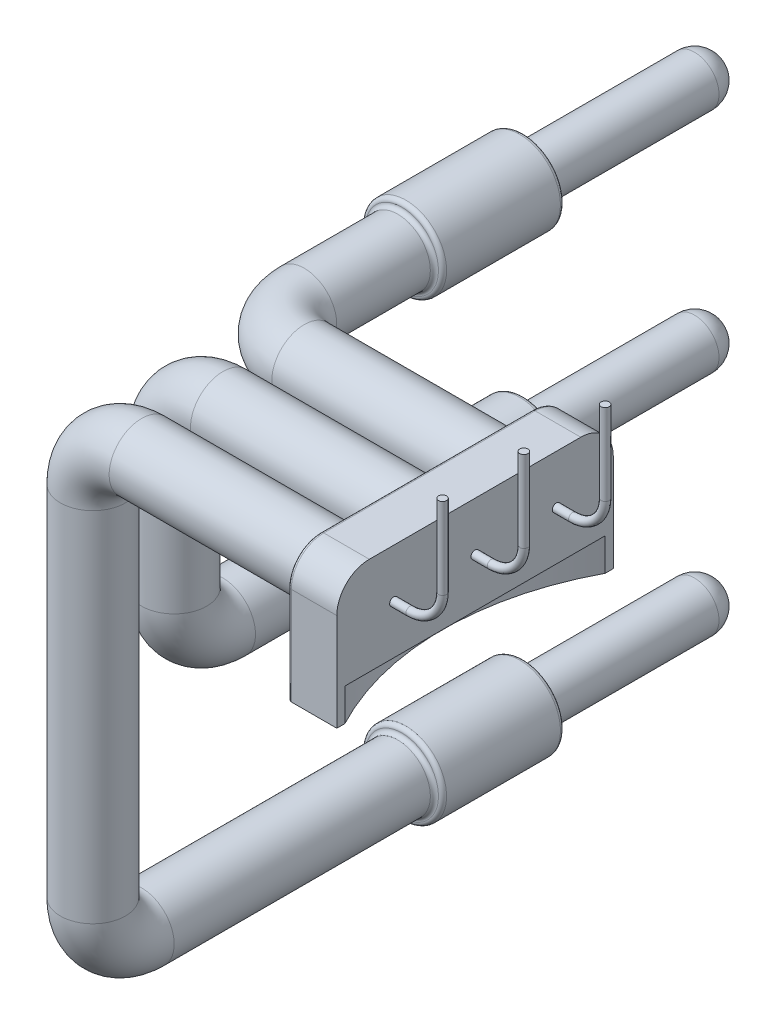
ISO-10303-21;
HEADER;
FILE_DESCRIPTION(('STEP AP214'),'2;1');
FILE_NAME('part.step','',(''),(''),'','','');
FILE_SCHEMA(('AUTOMOTIVE_DESIGN { 1 0 10303 214 1 1 1 1 }'));
ENDSEC;
DATA;
#1=APPLICATION_CONTEXT('core data for automotive mechanical design processes');
#2=APPLICATION_PROTOCOL_DEFINITION('international standard','automotive_design',2000,#1);
#3=PRODUCT_CONTEXT('',#1,'mechanical');
#4=PRODUCT('Part','Part','',(#3));
#5=PRODUCT_RELATED_PRODUCT_CATEGORY('part','',(#4));
#6=PRODUCT_DEFINITION_FORMATION('','',#4);
#7=PRODUCT_DEFINITION_CONTEXT('part definition',#1,'design');
#8=PRODUCT_DEFINITION('design','',#6,#7);
#9=PRODUCT_DEFINITION_SHAPE('','',#8);
#10=(LENGTH_UNIT() NAMED_UNIT(*) SI_UNIT(.MILLI.,.METRE.));
#11=(NAMED_UNIT(*) PLANE_ANGLE_UNIT() SI_UNIT($,.RADIAN.));
#12=(NAMED_UNIT(*) SI_UNIT($,.STERADIAN.) SOLID_ANGLE_UNIT());
#13=UNCERTAINTY_MEASURE_WITH_UNIT(LENGTH_MEASURE(1.E-05),#10,'distance_accuracy_value','');
#14=(GEOMETRIC_REPRESENTATION_CONTEXT(3) GLOBAL_UNCERTAINTY_ASSIGNED_CONTEXT((#13)) GLOBAL_UNIT_ASSIGNED_CONTEXT((#10,
#11,#12)) REPRESENTATION_CONTEXT('',''));
#15=CARTESIAN_POINT('',(0.,0.,0.));
#16=DIRECTION('',(0.,0.,1.));
#17=DIRECTION('',(1.,0.,0.));
#18=AXIS2_PLACEMENT_3D('',#15,#16,#17);
#19=CARTESIAN_POINT('',(18.5,1.,27.));
#20=DIRECTION('',(1.,0.,0.));
#21=DIRECTION('',(0.,0.,-1.));
#22=AXIS2_PLACEMENT_3D('',#19,#20,#21);
#23=PLANE('',#22);
#24=CARTESIAN_POINT('',(18.5,0.,33.5));
#25=DIRECTION('',(1.,0.,0.));
#26=DIRECTION('',(0.,0.,-1.));
#27=AXIS2_PLACEMENT_3D('',#24,#25,#26);
#28=CIRCLE('',#27,0.25);
#29=CARTESIAN_POINT('',(18.5,0.,33.25));
#30=VERTEX_POINT('',#29);
#31=EDGE_CURVE('E814',#30,#30,#28,.T.);
#32=ORIENTED_EDGE('',*,*,#31,.F.);
#33=EDGE_LOOP('',(#32));
#34=FACE_BOUND('',#33,.T.);
#35=DIRECTION('',(0.,0.,1.));
#36=VECTOR('',#35,1.);
#37=CARTESIAN_POINT('',(18.5,-3.,42.));
#38=LINE('',#37,#36);
#39=CARTESIAN_POINT('',(18.5,-3.,25.5));
#40=VERTEX_POINT('',#39);
#41=CARTESIAN_POINT('',(18.5,-2.99999999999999,41.5));
#42=VERTEX_POINT('',#41);
#43=EDGE_CURVE('E124',#40,#42,#38,.T.);
#44=ORIENTED_EDGE('',*,*,#43,.F.);
#45=DIRECTION('',(0.,1.,0.));
#46=VECTOR('',#45,1.);
#47=CARTESIAN_POINT('',(18.5,-5.,25.5));
#48=LINE('',#47,#46);
#49=CARTESIAN_POINT('',(18.5,-5.,25.5));
#50=VERTEX_POINT('',#49);
#51=EDGE_CURVE('E142',#50,#40,#48,.T.);
#52=ORIENTED_EDGE('',*,*,#51,.F.);
#53=DIRECTION('',(0.,0.,1.));
#54=VECTOR('',#53,1.);
#55=CARTESIAN_POINT('',(18.5,-5.,25.));
#56=LINE('',#55,#54);
#57=CARTESIAN_POINT('',(18.5,-5.,25.));
#58=VERTEX_POINT('',#57);
#59=EDGE_CURVE('E165',#58,#50,#56,.T.);
#60=ORIENTED_EDGE('',*,*,#59,.F.);
#61=DIRECTION('',(0.,-1.,0.));
#62=VECTOR('',#61,1.);
#63=CARTESIAN_POINT('',(18.5,-3.,25.));
#64=LINE('',#63,#62);
#65=CARTESIAN_POINT('',(18.5,1.,25.));
#66=VERTEX_POINT('',#65);
#67=EDGE_CURVE('E283',#66,#58,#64,.T.);
#68=ORIENTED_EDGE('',*,*,#67,.F.);
#69=CARTESIAN_POINT('',(18.5,1.,27.));
#70=DIRECTION('',(-1.,0.,0.));
#71=DIRECTION('',(0.,0.,-1.));
#72=AXIS2_PLACEMENT_3D('',#69,#70,#71);
#73=CIRCLE('',#72,2.);
#74=CARTESIAN_POINT('',(18.5,3.,27.));
#75=VERTEX_POINT('',#74);
#76=EDGE_CURVE('E291',#75,#66,#73,.T.);
#77=ORIENTED_EDGE('',*,*,#76,.F.);
#78=DIRECTION('',(0.,0.,-1.));
#79=VECTOR('',#78,1.);
#80=CARTESIAN_POINT('',(18.5,3.,27.));
#81=LINE('',#80,#79);
#82=CARTESIAN_POINT('',(18.5,3.,40.));
#83=VERTEX_POINT('',#82);
#84=EDGE_CURVE('E294',#83,#75,#81,.T.);
#85=ORIENTED_EDGE('',*,*,#84,.F.);
#86=CARTESIAN_POINT('',(18.5,1.,40.));
#87=DIRECTION('',(-1.,0.,0.));
#88=DIRECTION('',(0.,0.,1.));
#89=AXIS2_PLACEMENT_3D('',#86,#87,#88);
#90=CIRCLE('',#89,2.);
#91=CARTESIAN_POINT('',(18.5,1.,42.));
#92=VERTEX_POINT('',#91);
#93=EDGE_CURVE('E296',#92,#83,#90,.T.);
#94=ORIENTED_EDGE('',*,*,#93,.F.);
#95=DIRECTION('',(0.,1.,0.));
#96=VECTOR('',#95,1.);
#97=CARTESIAN_POINT('',(18.5,1.,42.));
#98=LINE('',#97,#96);
#99=CARTESIAN_POINT('',(18.5,-4.99999999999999,42.));
#100=VERTEX_POINT('',#99);
#101=EDGE_CURVE('E132',#100,#92,#98,.T.);
#102=ORIENTED_EDGE('',*,*,#101,.F.);
#103=DIRECTION('',(0.,0.,1.));
#104=VECTOR('',#103,1.);
#105=CARTESIAN_POINT('',(18.5,-4.99999999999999,41.5));
#106=LINE('',#105,#104);
#107=CARTESIAN_POINT('',(18.5,-4.99999999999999,41.5));
#108=VERTEX_POINT('',#107);
#109=EDGE_CURVE('E138',#108,#100,#106,.T.);
#110=ORIENTED_EDGE('',*,*,#109,.F.);
#111=DIRECTION('',(0.,1.,0.));
#112=VECTOR('',#111,1.);
#113=CARTESIAN_POINT('',(18.5,-4.99999999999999,41.5));
#114=LINE('',#113,#112);
#115=EDGE_CURVE('E133',#108,#42,#114,.T.);
#116=ORIENTED_EDGE('',*,*,#115,.T.);
#117=EDGE_LOOP('',(#44,#52,#60,#68,#77,#85,#94,#102,#110,#116));
#118=FACE_BOUND('',#117,.T.);
#119=CARTESIAN_POINT('',(18.5,0.,38.5));
#120=DIRECTION('',(1.,0.,0.));
#121=DIRECTION('',(0.,0.,-1.));
#122=AXIS2_PLACEMENT_3D('',#119,#120,#121);
#123=CIRCLE('',#122,0.25);
#124=CARTESIAN_POINT('',(18.5,0.,38.25));
#125=VERTEX_POINT('',#124);
#126=EDGE_CURVE('E833',#125,#125,#123,.T.);
#127=ORIENTED_EDGE('',*,*,#126,.F.);
#128=EDGE_LOOP('',(#127));
#129=FACE_BOUND('',#128,.T.);
#130=CARTESIAN_POINT('',(18.5,0.,28.5));
#131=DIRECTION('',(1.,0.,0.));
#132=DIRECTION('',(0.,0.,-1.));
#133=AXIS2_PLACEMENT_3D('',#130,#131,#132);
#134=CIRCLE('',#133,0.25);
#135=CARTESIAN_POINT('',(18.5,0.,28.25));
#136=VERTEX_POINT('',#135);
#137=EDGE_CURVE('E849',#136,#136,#134,.T.);
#138=ORIENTED_EDGE('',*,*,#137,.F.);
#139=EDGE_LOOP('',(#138));
#140=FACE_BOUND('',#139,.T.);
#141=ADVANCED_FACE('F30',(#34,#118,#129,#140),#23,.T.);
#142=CARTESIAN_POINT('',(1.06232211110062E-13,-28.,12.));
#143=DIRECTION('',(0.,0.,-1.));
#144=DIRECTION('',(-1.,0.,0.));
#145=AXIS2_PLACEMENT_3D('',#142,#143,#144);
#146=PLANE('',#145);
#147=CARTESIAN_POINT('',(1.06232211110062E-13,-28.,12.));
#148=DIRECTION('',(0.,0.,-1.));
#149=DIRECTION('',(-1.,0.,0.));
#150=AXIS2_PLACEMENT_3D('',#147,#148,#149);
#151=CIRCLE('',#150,2.25000000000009);
#152=CARTESIAN_POINT('',(-2.24999999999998,-28.,12.));
#153=VERTEX_POINT('',#152);
#154=EDGE_CURVE('E178',#153,#153,#151,.T.);
#155=ORIENTED_EDGE('',*,*,#154,.T.);
#156=EDGE_LOOP('',(#155));
#157=FACE_BOUND('',#156,.T.);
#158=CARTESIAN_POINT('',(0.,-28.,12.));
#159=DIRECTION('',(0.,0.,-1.));
#160=DIRECTION('',(-1.,0.,0.));
#161=AXIS2_PLACEMENT_3D('',#158,#159,#160);
#162=CIRCLE('',#161,1.5);
#163=CARTESIAN_POINT('',(-1.49999999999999,-28.,12.));
#164=VERTEX_POINT('',#163);
#165=EDGE_CURVE('E270',#164,#164,#162,.T.);
#166=ORIENTED_EDGE('',*,*,#165,.F.);
#167=EDGE_LOOP('',(#166));
#168=FACE_BOUND('',#167,.T.);
#169=ADVANCED_FACE('F391',(#157,#168),#146,.T.);
#170=CARTESIAN_POINT('',(1.0617403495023E-13,-14.,12.));
#171=DIRECTION('',(0.,0.,-1.));
#172=DIRECTION('',(-1.,0.,0.));
#173=AXIS2_PLACEMENT_3D('',#170,#171,#172);
#174=PLANE('',#173);
#175=CARTESIAN_POINT('',(1.0617403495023E-13,-14.,12.));
#176=DIRECTION('',(0.,0.,-1.));
#177=DIRECTION('',(-1.,0.,0.));
#178=AXIS2_PLACEMENT_3D('',#175,#176,#177);
#179=CIRCLE('',#178,2.25000000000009);
#180=CARTESIAN_POINT('',(-2.24999999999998,-14.,12.));
#181=VERTEX_POINT('',#180);
#182=EDGE_CURVE('E190',#181,#181,#179,.T.);
#183=ORIENTED_EDGE('',*,*,#182,.T.);
#184=EDGE_LOOP('',(#183));
#185=FACE_BOUND('',#184,.T.);
#186=CARTESIAN_POINT('',(0.,-14.,12.));
#187=DIRECTION('',(0.,0.,-1.));
#188=DIRECTION('',(-1.,0.,0.));
#189=AXIS2_PLACEMENT_3D('',#186,#187,#188);
#190=CIRCLE('',#189,1.5);
#191=CARTESIAN_POINT('',(-1.49999999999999,-14.,12.));
#192=VERTEX_POINT('',#191);
#193=EDGE_CURVE('E262',#192,#192,#190,.T.);
#194=ORIENTED_EDGE('',*,*,#193,.F.);
#195=EDGE_LOOP('',(#194));
#196=FACE_BOUND('',#195,.T.);
#197=ADVANCED_FACE('F397',(#185,#196),#174,.T.);
#198=CARTESIAN_POINT('',(15.5,0.,38.5));
#199=DIRECTION('',(1.,0.,0.));
#200=DIRECTION('',(0.,0.,-1.));
#201=AXIS2_PLACEMENT_3D('',#198,#199,#200);
#202=PLANE('',#201);
#203=DIRECTION('',(0.,-1.,0.));
#204=VECTOR('',#203,1.);
#205=CARTESIAN_POINT('',(15.5,-5.,25.2));
#206=LINE('',#205,#204);
#207=CARTESIAN_POINT('',(15.5,1.,25.2));
#208=VERTEX_POINT('',#207);
#209=CARTESIAN_POINT('',(15.5,-4.8,25.2));
#210=VERTEX_POINT('',#209);
#211=EDGE_CURVE('E355',#208,#210,#206,.T.);
#212=ORIENTED_EDGE('',*,*,#211,.T.);
#213=DIRECTION('',(0.,0.,-1.));
#214=VECTOR('',#213,1.);
#215=CARTESIAN_POINT('',(15.5,-4.8,42.));
#216=LINE('',#215,#214);
#217=CARTESIAN_POINT('',(15.5,-4.8,41.8));
#218=VERTEX_POINT('',#217);
#219=EDGE_CURVE('E345',#210,#218,#216,.F.);
#220=ORIENTED_EDGE('',*,*,#219,.T.);
#221=DIRECTION('',(0.,1.,0.));
#222=VECTOR('',#221,1.);
#223=CARTESIAN_POINT('',(15.5,1.,41.8));
#224=LINE('',#223,#222);
#225=CARTESIAN_POINT('',(15.5,1.,41.8));
#226=VERTEX_POINT('',#225);
#227=EDGE_CURVE('E350',#218,#226,#224,.T.);
#228=ORIENTED_EDGE('',*,*,#227,.T.);
#229=CARTESIAN_POINT('',(15.5,1.,40.));
#230=DIRECTION('',(1.,0.,0.));
#231=DIRECTION('',(0.,0.,-1.));
#232=AXIS2_PLACEMENT_3D('',#229,#230,#231);
#233=CIRCLE('',#232,1.8);
#234=CARTESIAN_POINT('',(15.5,2.8,40.));
#235=VERTEX_POINT('',#234);
#236=EDGE_CURVE('E353',#226,#235,#233,.F.);
#237=ORIENTED_EDGE('',*,*,#236,.T.);
#238=DIRECTION('',(0.,0.,-1.));
#239=VECTOR('',#238,1.);
#240=CARTESIAN_POINT('',(15.5,2.8,27.));
#241=LINE('',#240,#239);
#242=CARTESIAN_POINT('',(15.5,2.8,27.));
#243=VERTEX_POINT('',#242);
#244=EDGE_CURVE('E174',#235,#243,#241,.T.);
#245=ORIENTED_EDGE('',*,*,#244,.T.);
#246=CARTESIAN_POINT('',(15.5,1.,27.));
#247=DIRECTION('',(1.,0.,0.));
#248=DIRECTION('',(0.,0.,-1.));
#249=AXIS2_PLACEMENT_3D('',#246,#247,#248);
#250=CIRCLE('',#249,1.8);
#251=EDGE_CURVE('E325',#243,#208,#250,.F.);
#252=ORIENTED_EDGE('',*,*,#251,.T.);
#253=EDGE_LOOP('',(#212,#220,#228,#237,#245,#252));
#254=FACE_BOUND('',#253,.T.);
#255=CARTESIAN_POINT('',(15.5,0.,38.5));
#256=DIRECTION('',(-1.,0.,0.));
#257=DIRECTION('',(0.,0.,1.));
#258=AXIS2_PLACEMENT_3D('',#255,#256,#257);
#259=CIRCLE('',#258,2.);
#260=CARTESIAN_POINT('',(15.5,0.,40.5));
#261=VERTEX_POINT('',#260);
#262=EDGE_CURVE('E206',#261,#261,#259,.T.);
#263=ORIENTED_EDGE('',*,*,#262,.F.);
#264=EDGE_LOOP('',(#263));
#265=FACE_BOUND('',#264,.T.);
#266=CARTESIAN_POINT('',(15.5,0.,28.5));
#267=DIRECTION('',(1.,0.,0.));
#268=DIRECTION('',(0.,0.,-1.));
#269=AXIS2_PLACEMENT_3D('',#266,#267,#268);
#270=CIRCLE('',#269,2.);
#271=CARTESIAN_POINT('',(15.5,0.,26.5));
#272=VERTEX_POINT('',#271);
#273=EDGE_CURVE('E225',#272,#272,#270,.T.);
#274=ORIENTED_EDGE('',*,*,#273,.T.);
#275=EDGE_LOOP('',(#274));
#276=FACE_BOUND('',#275,.T.);
#277=CARTESIAN_POINT('',(15.5,0.,33.5));
#278=DIRECTION('',(-1.,0.,0.));
#279=DIRECTION('',(0.,0.,1.));
#280=AXIS2_PLACEMENT_3D('',#277,#278,#279);
#281=CIRCLE('',#280,2.);
#282=CARTESIAN_POINT('',(15.5,0.,35.5));
#283=VERTEX_POINT('',#282);
#284=EDGE_CURVE('E202',#283,#283,#281,.T.);
#285=ORIENTED_EDGE('',*,*,#284,.F.);
#286=EDGE_LOOP('',(#285));
#287=FACE_BOUND('',#286,.T.);
#288=ADVANCED_FACE('F360',(#254,#265,#276,#287),#202,.F.);
#289=CARTESIAN_POINT('',(0.,0.,12.));
#290=DIRECTION('',(0.,0.,-1.));
#291=DIRECTION('',(-1.,0.,0.));
#292=AXIS2_PLACEMENT_3D('',#289,#290,#291);
#293=CYLINDRICAL_SURFACE('',#292,1.5);
#294=CARTESIAN_POINT('',(0.,0.,1.5));
#295=DIRECTION('',(0.,0.,-1.));
#296=DIRECTION('',(-1.,0.,0.));
#297=AXIS2_PLACEMENT_3D('',#294,#295,#296);
#298=CIRCLE('',#297,1.5);
#299=CARTESIAN_POINT('',(-1.5,0.,1.5));
#300=VERTEX_POINT('',#299);
#301=EDGE_CURVE('E219',#300,#300,#298,.F.);
#302=ORIENTED_EDGE('',*,*,#301,.T.);
#303=EDGE_LOOP('',(#302));
#304=FACE_BOUND('',#303,.T.);
#305=CARTESIAN_POINT('',(0.,0.,12.));
#306=DIRECTION('',(0.,0.,1.));
#307=DIRECTION('',(1.,0.,0.));
#308=AXIS2_PLACEMENT_3D('',#305,#306,#307);
#309=CIRCLE('',#308,1.5);
#310=CARTESIAN_POINT('',(1.5,0.,12.));
#311=VERTEX_POINT('',#310);
#312=EDGE_CURVE('E222',#311,#311,#309,.T.);
#313=ORIENTED_EDGE('',*,*,#312,.F.);
#314=EDGE_LOOP('',(#313));
#315=FACE_BOUND('',#314,.T.);
#316=ADVANCED_FACE('F32',(#304,#315),#293,.T.);
#317=CARTESIAN_POINT('',(0.,0.,1.5));
#318=DIRECTION('',(0.,0.,1.));
#319=DIRECTION('',(1.,0.,0.));
#320=AXIS2_PLACEMENT_3D('',#317,#318,#319);
#321=SPHERICAL_SURFACE('',#320,1.5);
#322=ORIENTED_EDGE('',*,*,#301,.F.);
#323=EDGE_LOOP('',(#322));
#324=FACE_BOUND('',#323,.T.);
#325=ADVANCED_FACE('F538',(#324),#321,.T.);
#326=CARTESIAN_POINT('',(0.,0.,12.));
#327=DIRECTION('',(0.,0.,1.));
#328=DIRECTION('',(1.,0.,0.));
#329=AXIS2_PLACEMENT_3D('',#326,#327,#328);
#330=PLANE('',#329);
#331=CARTESIAN_POINT('',(0.,0.,12.));
#332=DIRECTION('',(0.,0.,1.));
#333=DIRECTION('',(1.,0.,0.));
#334=AXIS2_PLACEMENT_3D('',#331,#332,#333);
#335=CIRCLE('',#334,2.25);
#336=CARTESIAN_POINT('',(2.25,0.,12.));
#337=VERTEX_POINT('',#336);
#338=EDGE_CURVE('E210',#337,#337,#335,.F.);
#339=ORIENTED_EDGE('',*,*,#338,.T.);
#340=EDGE_LOOP('',(#339));
#341=FACE_BOUND('',#340,.T.);
#342=ORIENTED_EDGE('',*,*,#312,.T.);
#343=EDGE_LOOP('',(#342));
#344=FACE_BOUND('',#343,.T.);
#345=ADVANCED_FACE('F535',(#341,#344),#330,.F.);
#346=CARTESIAN_POINT('',(0.,0.,19.5));
#347=DIRECTION('',(0.,0.,-1.));
#348=DIRECTION('',(-1.,0.,0.));
#349=AXIS2_PLACEMENT_3D('',#346,#347,#348);
#350=CYLINDRICAL_SURFACE('',#349,2.5);
#351=CARTESIAN_POINT('',(0.,0.,12.25));
#352=DIRECTION('',(0.,0.,1.));
#353=DIRECTION('',(1.,0.,0.));
#354=AXIS2_PLACEMENT_3D('',#351,#352,#353);
#355=CIRCLE('',#354,2.5);
#356=CARTESIAN_POINT('',(2.5,0.,12.25));
#357=VERTEX_POINT('',#356);
#358=EDGE_CURVE('E213',#357,#357,#355,.T.);
#359=ORIENTED_EDGE('',*,*,#358,.T.);
#360=EDGE_LOOP('',(#359));
#361=FACE_BOUND('',#360,.T.);
#362=CARTESIAN_POINT('',(0.,0.,19.25));
#363=DIRECTION('',(0.,0.,1.));
#364=DIRECTION('',(1.,0.,0.));
#365=AXIS2_PLACEMENT_3D('',#362,#363,#364);
#366=CIRCLE('',#365,2.5);
#367=CARTESIAN_POINT('',(2.5,0.,19.25));
#368=VERTEX_POINT('',#367);
#369=EDGE_CURVE('E216',#368,#368,#366,.F.);
#370=ORIENTED_EDGE('',*,*,#369,.T.);
#371=EDGE_LOOP('',(#370));
#372=FACE_BOUND('',#371,.T.);
#373=ADVANCED_FACE('F533',(#361,#372),#350,.T.);
#374=CARTESIAN_POINT('',(0.,0.,20.5));
#375=DIRECTION('',(0.,0.,-1.));
#376=DIRECTION('',(-1.,0.,0.));
#377=AXIS2_PLACEMENT_3D('',#374,#375,#376);
#378=CYLINDRICAL_SURFACE('',#377,2.);
#379=CARTESIAN_POINT('',(0.,0.,19.75));
#380=DIRECTION('',(0.,0.,1.));
#381=DIRECTION('',(1.,0.,0.));
#382=AXIS2_PLACEMENT_3D('',#379,#380,#381);
#383=CIRCLE('',#382,2.);
#384=CARTESIAN_POINT('',(2.,0.,19.75));
#385=VERTEX_POINT('',#384);
#386=EDGE_CURVE('E203',#385,#385,#383,.T.);
#387=ORIENTED_EDGE('',*,*,#386,.T.);
#388=EDGE_LOOP('',(#387));
#389=FACE_BOUND('',#388,.T.);
#390=CARTESIAN_POINT('',(0.,0.,25.5));
#391=DIRECTION('',(0.,0.,1.));
#392=DIRECTION('',(1.,0.,0.));
#393=AXIS2_PLACEMENT_3D('',#390,#391,#392);
#394=CIRCLE('',#393,2.);
#395=CARTESIAN_POINT('',(-2.,0.,25.5));
#396=VERTEX_POINT('',#395);
#397=EDGE_CURVE('E231',#396,#396,#394,.T.);
#398=ORIENTED_EDGE('',*,*,#397,.F.);
#399=EDGE_LOOP('',(#398));
#400=FACE_BOUND('',#399,.T.);
#401=ADVANCED_FACE('F529',(#389,#400),#378,.T.);
#402=CARTESIAN_POINT('',(3.,0.,28.5));
#403=DIRECTION('',(1.,0.,0.));
#404=DIRECTION('',(0.,0.,-1.));
#405=AXIS2_PLACEMENT_3D('',#402,#403,#404);
#406=CYLINDRICAL_SURFACE('',#405,2.);
#407=CARTESIAN_POINT('',(3.,0.,28.5));
#408=DIRECTION('',(1.,0.,0.));
#409=DIRECTION('',(0.,0.,-1.));
#410=AXIS2_PLACEMENT_3D('',#407,#408,#409);
#411=CIRCLE('',#410,2.);
#412=CARTESIAN_POINT('',(3.,0.,30.5));
#413=VERTEX_POINT('',#412);
#414=EDGE_CURVE('E228',#413,#413,#411,.T.);
#415=ORIENTED_EDGE('',*,*,#414,.T.);
#416=EDGE_LOOP('',(#415));
#417=FACE_BOUND('',#416,.T.);
#418=ORIENTED_EDGE('',*,*,#273,.F.);
#419=EDGE_LOOP('',(#418));
#420=FACE_BOUND('',#419,.T.);
#421=ADVANCED_FACE('F525',(#417,#420),#406,.T.);
#422=CARTESIAN_POINT('',(3.,0.,25.5));
#423=DIRECTION('',(0.,1.,0.));
#424=DIRECTION('',(0.,0.,1.));
#425=AXIS2_PLACEMENT_3D('',#422,#423,#424);
#426=TOROIDAL_SURFACE('',#425,3.,2.);
#427=CARTESIAN_POINT('',(3.,0.,25.5));
#428=DIRECTION('',(0.,1.,0.));
#429=DIRECTION('',(0.,0.,1.));
#430=AXIS2_PLACEMENT_3D('',#427,#428,#429);
#431=CIRCLE('',#430,5.);
#432=EDGE_CURVE('',#396,#413,#431,.T.);
#433=ORIENTED_EDGE('',*,*,#397,.T.);
#434=ORIENTED_EDGE('',*,*,#414,.F.);
#435=ORIENTED_EDGE('',*,*,#432,.T.);
#436=ORIENTED_EDGE('',*,*,#432,.F.);
#437=EDGE_LOOP('',(#433,#435,#434,#436));
#438=FACE_BOUND('',#437,.T.);
#439=ADVANCED_FACE('F521',(#438),#426,.T.);
#440=CARTESIAN_POINT('',(0.,0.,12.25));
#441=DIRECTION('',(0.,0.,1.));
#442=DIRECTION('',(1.,0.,0.));
#443=AXIS2_PLACEMENT_3D('',#440,#441,#442);
#444=TOROIDAL_SURFACE('',#443,2.25,0.25);
#445=ORIENTED_EDGE('',*,*,#338,.F.);
#446=EDGE_LOOP('',(#445));
#447=FACE_BOUND('',#446,.T.);
#448=ORIENTED_EDGE('',*,*,#358,.F.);
#449=EDGE_LOOP('',(#448));
#450=FACE_BOUND('',#449,.T.);
#451=ADVANCED_FACE('F517',(#447,#450),#444,.T.);
#452=CARTESIAN_POINT('',(0.,0.,19.25));
#453=DIRECTION('',(0.,0.,1.));
#454=DIRECTION('',(1.,0.,0.));
#455=AXIS2_PLACEMENT_3D('',#452,#453,#454);
#456=TOROIDAL_SURFACE('',#455,2.25,0.25);
#457=ORIENTED_EDGE('',*,*,#369,.F.);
#458=EDGE_LOOP('',(#457));
#459=FACE_BOUND('',#458,.T.);
#460=CARTESIAN_POINT('',(0.,0.,19.5));
#461=DIRECTION('',(0.,0.,1.));
#462=DIRECTION('',(1.,0.,0.));
#463=AXIS2_PLACEMENT_3D('',#460,#461,#462);
#464=CIRCLE('',#463,2.25);
#465=CARTESIAN_POINT('',(2.25,0.,19.5));
#466=VERTEX_POINT('',#465);
#467=EDGE_CURVE('E207',#466,#466,#464,.T.);
#468=ORIENTED_EDGE('',*,*,#467,.F.);
#469=EDGE_LOOP('',(#468));
#470=FACE_BOUND('',#469,.T.);
#471=ADVANCED_FACE('F513',(#459,#470),#456,.T.);
#472=CARTESIAN_POINT('',(0.,0.,19.75));
#473=DIRECTION('',(0.,0.,1.));
#474=DIRECTION('',(1.,0.,0.));
#475=AXIS2_PLACEMENT_3D('',#472,#473,#474);
#476=TOROIDAL_SURFACE('',#475,2.25,0.25);
#477=ORIENTED_EDGE('',*,*,#467,.T.);
#478=EDGE_LOOP('',(#477));
#479=FACE_BOUND('',#478,.T.);
#480=ORIENTED_EDGE('',*,*,#386,.F.);
#481=EDGE_LOOP('',(#480));
#482=FACE_BOUND('',#481,.T.);
#483=ADVANCED_FACE('F507',(#479,#482),#476,.F.);
#484=CARTESIAN_POINT('',(0.,-3.00000000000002,38.5));
#485=DIRECTION('',(0.,-1.,0.));
#486=DIRECTION('',(1.,0.,0.));
#487=AXIS2_PLACEMENT_3D('',#484,#485,#486);
#488=CYLINDRICAL_SURFACE('',#487,2.);
#489=CARTESIAN_POINT('',(0.,-3.00000000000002,38.5));
#490=DIRECTION('',(0.,-1.,0.));
#491=DIRECTION('',(0.,0.,1.));
#492=AXIS2_PLACEMENT_3D('',#489,#490,#491);
#493=CIRCLE('',#492,2.);
#494=CARTESIAN_POINT('',(-2.,-3.00000000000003,38.5));
#495=VERTEX_POINT('',#494);
#496=EDGE_CURVE('E234',#495,#495,#493,.T.);
#497=ORIENTED_EDGE('',*,*,#496,.T.);
#498=EDGE_LOOP('',(#497));
#499=FACE_BOUND('',#498,.T.);
#500=CARTESIAN_POINT('',(0.,-25.,38.5));
#501=DIRECTION('',(0.,-1.,0.));
#502=DIRECTION('',(1.,0.,0.));
#503=AXIS2_PLACEMENT_3D('',#500,#501,#502);
#504=CIRCLE('',#503,2.00000000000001);
#505=CARTESIAN_POINT('',(0.,-25.,40.5));
#506=VERTEX_POINT('',#505);
#507=EDGE_CURVE('E259',#506,#506,#504,.T.);
#508=ORIENTED_EDGE('',*,*,#507,.F.);
#509=EDGE_LOOP('',(#508));
#510=FACE_BOUND('',#509,.T.);
#511=ADVANCED_FACE('F503',(#499,#510),#488,.T.);
#512=CARTESIAN_POINT('',(3.,-3.,38.5));
#513=DIRECTION('',(0.,0.,1.));
#514=DIRECTION('',(1.,0.,0.));
#515=AXIS2_PLACEMENT_3D('',#512,#513,#514);
#516=TOROIDAL_SURFACE('',#515,3.,2.);
#517=CARTESIAN_POINT('',(3.00000000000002,0.,38.5));
#518=DIRECTION('',(-1.,0.,0.));
#519=DIRECTION('',(0.,0.,1.));
#520=AXIS2_PLACEMENT_3D('',#517,#518,#519);
#521=CIRCLE('',#520,2.);
#522=CARTESIAN_POINT('',(3.00000000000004,2.,38.5));
#523=VERTEX_POINT('',#522);
#524=EDGE_CURVE('E237',#523,#523,#521,.T.);
#525=CARTESIAN_POINT('',(3.,-3.,38.5));
#526=DIRECTION('',(0.,0.,1.));
#527=DIRECTION('',(1.,0.,0.));
#528=AXIS2_PLACEMENT_3D('',#525,#526,#527);
#529=CIRCLE('',#528,5.);
#530=EDGE_CURVE('',#523,#495,#529,.T.);
#531=ORIENTED_EDGE('',*,*,#524,.T.);
#532=ORIENTED_EDGE('',*,*,#496,.F.);
#533=ORIENTED_EDGE('',*,*,#530,.T.);
#534=ORIENTED_EDGE('',*,*,#530,.F.);
#535=EDGE_LOOP('',(#531,#533,#532,#534));
#536=FACE_BOUND('',#535,.T.);
#537=ADVANCED_FACE('F499',(#536),#516,.T.);
#538=CARTESIAN_POINT('',(3.00000000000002,0.,38.5));
#539=DIRECTION('',(1.,0.,0.));
#540=DIRECTION('',(0.,1.,0.));
#541=AXIS2_PLACEMENT_3D('',#538,#539,#540);
#542=CYLINDRICAL_SURFACE('',#541,2.);
#543=ORIENTED_EDGE('',*,*,#524,.F.);
#544=EDGE_LOOP('',(#543));
#545=FACE_BOUND('',#544,.T.);
#546=ORIENTED_EDGE('',*,*,#262,.T.);
#547=EDGE_LOOP('',(#546));
#548=FACE_BOUND('',#547,.T.);
#549=ADVANCED_FACE('F495',(#545,#548),#542,.T.);
#550=CARTESIAN_POINT('',(0.,-3.00000000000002,33.5));
#551=DIRECTION('',(0.,-1.,0.));
#552=DIRECTION('',(0.,0.,-1.));
#553=AXIS2_PLACEMENT_3D('',#550,#551,#552);
#554=CYLINDRICAL_SURFACE('',#553,2.);
#555=CARTESIAN_POINT('',(0.,-3.00000000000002,33.5));
#556=DIRECTION('',(0.,-1.,0.));
#557=DIRECTION('',(0.,0.,1.));
#558=AXIS2_PLACEMENT_3D('',#555,#556,#557);
#559=CIRCLE('',#558,2.);
#560=CARTESIAN_POINT('',(-2.,-3.00000000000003,33.5));
#561=VERTEX_POINT('',#560);
#562=EDGE_CURVE('E240',#561,#561,#559,.T.);
#563=ORIENTED_EDGE('',*,*,#562,.T.);
#564=EDGE_LOOP('',(#563));
#565=FACE_BOUND('',#564,.T.);
#566=CARTESIAN_POINT('',(0.,-11.,33.5));
#567=DIRECTION('',(0.,-1.,0.));
#568=DIRECTION('',(1.,0.,0.));
#569=AXIS2_PLACEMENT_3D('',#566,#567,#568);
#570=CIRCLE('',#569,2.);
#571=CARTESIAN_POINT('',(0.,-11.,35.5));
#572=VERTEX_POINT('',#571);
#573=EDGE_CURVE('E253',#572,#572,#570,.T.);
#574=ORIENTED_EDGE('',*,*,#573,.F.);
#575=EDGE_LOOP('',(#574));
#576=FACE_BOUND('',#575,.T.);
#577=ADVANCED_FACE('F491',(#565,#576),#554,.T.);
#578=CARTESIAN_POINT('',(3.,-3.,33.5));
#579=DIRECTION('',(0.,0.,1.));
#580=DIRECTION('',(1.,0.,0.));
#581=AXIS2_PLACEMENT_3D('',#578,#579,#580);
#582=TOROIDAL_SURFACE('',#581,3.,2.);
#583=CARTESIAN_POINT('',(3.00000000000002,0.,33.5));
#584=DIRECTION('',(-1.,0.,0.));
#585=DIRECTION('',(0.,0.,1.));
#586=AXIS2_PLACEMENT_3D('',#583,#584,#585);
#587=CIRCLE('',#586,2.);
#588=CARTESIAN_POINT('',(3.00000000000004,2.,33.5));
#589=VERTEX_POINT('',#588);
#590=EDGE_CURVE('E245',#589,#589,#587,.T.);
#591=CARTESIAN_POINT('',(3.,-3.,33.5));
#592=DIRECTION('',(0.,0.,1.));
#593=DIRECTION('',(1.,0.,0.));
#594=AXIS2_PLACEMENT_3D('',#591,#592,#593);
#595=CIRCLE('',#594,5.);
#596=EDGE_CURVE('',#589,#561,#595,.T.);
#597=ORIENTED_EDGE('',*,*,#590,.T.);
#598=ORIENTED_EDGE('',*,*,#562,.F.);
#599=ORIENTED_EDGE('',*,*,#596,.T.);
#600=ORIENTED_EDGE('',*,*,#596,.F.);
#601=EDGE_LOOP('',(#597,#599,#598,#600));
#602=FACE_BOUND('',#601,.T.);
#603=ADVANCED_FACE('F487',(#602),#582,.T.);
#604=CARTESIAN_POINT('',(3.00000000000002,0.,33.5));
#605=DIRECTION('',(1.,0.,0.));
#606=DIRECTION('',(0.,0.,-1.));
#607=AXIS2_PLACEMENT_3D('',#604,#605,#606);
#608=CYLINDRICAL_SURFACE('',#607,2.);
#609=ORIENTED_EDGE('',*,*,#590,.F.);
#610=EDGE_LOOP('',(#609));
#611=FACE_BOUND('',#610,.T.);
#612=ORIENTED_EDGE('',*,*,#284,.T.);
#613=EDGE_LOOP('',(#612));
#614=FACE_BOUND('',#613,.T.);
#615=ADVANCED_FACE('F483',(#611,#614),#608,.T.);
#616=CARTESIAN_POINT('',(0.,-14.,30.5));
#617=DIRECTION('',(0.,0.,-1.));
#618=DIRECTION('',(0.,1.,0.));
#619=AXIS2_PLACEMENT_3D('',#616,#617,#618);
#620=CYLINDRICAL_SURFACE('',#619,2.);
#621=CARTESIAN_POINT('',(0.,-14.,19.75));
#622=DIRECTION('',(0.,0.,-1.));
#623=DIRECTION('',(-1.,0.,0.));
#624=AXIS2_PLACEMENT_3D('',#621,#622,#623);
#625=CIRCLE('',#624,2.);
#626=CARTESIAN_POINT('',(-2.,-14.,19.75));
#627=VERTEX_POINT('',#626);
#628=EDGE_CURVE('E187',#627,#627,#625,.F.);
#629=ORIENTED_EDGE('',*,*,#628,.T.);
#630=EDGE_LOOP('',(#629));
#631=FACE_BOUND('',#630,.T.);
#632=CARTESIAN_POINT('',(0.,-14.,30.5));
#633=DIRECTION('',(0.,0.,-1.));
#634=DIRECTION('',(1.,0.,0.));
#635=AXIS2_PLACEMENT_3D('',#632,#633,#634);
#636=CIRCLE('',#635,2.);
#637=CARTESIAN_POINT('',(0.,-16.,30.5));
#638=VERTEX_POINT('',#637);
#639=EDGE_CURVE('E248',#638,#638,#636,.T.);
#640=ORIENTED_EDGE('',*,*,#639,.T.);
#641=EDGE_LOOP('',(#640));
#642=FACE_BOUND('',#641,.T.);
#643=ADVANCED_FACE('F479',(#631,#642),#620,.T.);
#644=CARTESIAN_POINT('',(0.,-11.,30.5));
#645=DIRECTION('',(1.,0.,0.));
#646=DIRECTION('',(0.,0.,-1.));
#647=AXIS2_PLACEMENT_3D('',#644,#645,#646);
#648=TOROIDAL_SURFACE('',#647,3.,2.);
#649=CARTESIAN_POINT('',(0.,-11.,30.5));
#650=DIRECTION('',(1.,0.,0.));
#651=DIRECTION('',(0.,0.,-1.));
#652=AXIS2_PLACEMENT_3D('',#649,#650,#651);
#653=CIRCLE('',#652,5.);
#654=EDGE_CURVE('',#572,#638,#653,.T.);
#655=ORIENTED_EDGE('',*,*,#573,.T.);
#656=ORIENTED_EDGE('',*,*,#639,.F.);
#657=ORIENTED_EDGE('',*,*,#654,.T.);
#658=ORIENTED_EDGE('',*,*,#654,.F.);
#659=EDGE_LOOP('',(#655,#657,#656,#658));
#660=FACE_BOUND('',#659,.T.);
#661=ADVANCED_FACE('F475',(#660),#648,.T.);
#662=CARTESIAN_POINT('',(0.,-28.,35.5));
#663=DIRECTION('',(0.,0.,-1.));
#664=DIRECTION('',(0.,1.,0.));
#665=AXIS2_PLACEMENT_3D('',#662,#663,#664);
#666=CYLINDRICAL_SURFACE('',#665,2.00000000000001);
#667=CARTESIAN_POINT('',(0.,-28.,19.75));
#668=DIRECTION('',(0.,0.,-1.));
#669=DIRECTION('',(-1.,0.,0.));
#670=AXIS2_PLACEMENT_3D('',#667,#668,#669);
#671=CIRCLE('',#670,2.00000000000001);
#672=CARTESIAN_POINT('',(-2.,-28.,19.75));
#673=VERTEX_POINT('',#672);
#674=EDGE_CURVE('E175',#673,#673,#671,.F.);
#675=ORIENTED_EDGE('',*,*,#674,.T.);
#676=EDGE_LOOP('',(#675));
#677=FACE_BOUND('',#676,.T.);
#678=CARTESIAN_POINT('',(0.,-28.,35.5));
#679=DIRECTION('',(0.,0.,-1.));
#680=DIRECTION('',(1.,0.,0.));
#681=AXIS2_PLACEMENT_3D('',#678,#679,#680);
#682=CIRCLE('',#681,2.00000000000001);
#683=CARTESIAN_POINT('',(0.,-30.,35.5));
#684=VERTEX_POINT('',#683);
#685=EDGE_CURVE('E256',#684,#684,#682,.T.);
#686=ORIENTED_EDGE('',*,*,#685,.T.);
#687=EDGE_LOOP('',(#686));
#688=FACE_BOUND('',#687,.T.);
#689=ADVANCED_FACE('F471',(#677,#688),#666,.T.);
#690=CARTESIAN_POINT('',(0.,-25.,35.5));
#691=DIRECTION('',(1.,0.,0.));
#692=DIRECTION('',(0.,0.,-1.));
#693=AXIS2_PLACEMENT_3D('',#690,#691,#692);
#694=TOROIDAL_SURFACE('',#693,3.00000000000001,2.00000000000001);
#695=CARTESIAN_POINT('',(0.,-25.,35.5));
#696=DIRECTION('',(1.,0.,0.));
#697=DIRECTION('',(0.,0.,-1.));
#698=AXIS2_PLACEMENT_3D('',#695,#696,#697);
#699=CIRCLE('',#698,5.00000000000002);
#700=EDGE_CURVE('',#506,#684,#699,.T.);
#701=ORIENTED_EDGE('',*,*,#507,.T.);
#702=ORIENTED_EDGE('',*,*,#685,.F.);
#703=ORIENTED_EDGE('',*,*,#700,.T.);
#704=ORIENTED_EDGE('',*,*,#700,.F.);
#705=EDGE_LOOP('',(#701,#703,#702,#704));
#706=FACE_BOUND('',#705,.T.);
#707=ADVANCED_FACE('F467',(#706),#694,.T.);
#708=CARTESIAN_POINT('',(1.0617403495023E-13,-14.,12.));
#709=DIRECTION('',(0.,0.,1.));
#710=DIRECTION('',(1.,0.,0.));
#711=AXIS2_PLACEMENT_3D('',#708,#709,#710);
#712=CYLINDRICAL_SURFACE('',#711,2.50000000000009);
#713=CARTESIAN_POINT('',(0.,-14.,19.25));
#714=DIRECTION('',(0.,0.,-1.));
#715=DIRECTION('',(-1.,0.,0.));
#716=AXIS2_PLACEMENT_3D('',#713,#714,#715);
#717=CIRCLE('',#716,2.50000000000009);
#718=CARTESIAN_POINT('',(-2.50000000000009,-14.,19.25));
#719=VERTEX_POINT('',#718);
#720=EDGE_CURVE('E193',#719,#719,#717,.T.);
#721=ORIENTED_EDGE('',*,*,#720,.T.);
#722=EDGE_LOOP('',(#721));
#723=FACE_BOUND('',#722,.T.);
#724=CARTESIAN_POINT('',(1.02636628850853E-13,-14.,12.25));
#725=DIRECTION('',(0.,0.,-1.));
#726=DIRECTION('',(-1.,0.,0.));
#727=AXIS2_PLACEMENT_3D('',#724,#725,#726);
#728=CIRCLE('',#727,2.50000000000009);
#729=CARTESIAN_POINT('',(-2.49999999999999,-14.,12.25));
#730=VERTEX_POINT('',#729);
#731=EDGE_CURVE('E196',#730,#730,#728,.F.);
#732=ORIENTED_EDGE('',*,*,#731,.T.);
#733=EDGE_LOOP('',(#732));
#734=FACE_BOUND('',#733,.T.);
#735=ADVANCED_FACE('F460',(#723,#734),#712,.T.);
#736=CARTESIAN_POINT('',(1.8399696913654E-13,-14.,0.));
#737=DIRECTION('',(0.,0.,1.));
#738=DIRECTION('',(1.,0.,0.));
#739=AXIS2_PLACEMENT_3D('',#736,#737,#738);
#740=CYLINDRICAL_SURFACE('',#739,1.5);
#741=CARTESIAN_POINT('',(1.62772532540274E-13,-14.,1.5));
#742=DIRECTION('',(0.,0.,1.));
#743=DIRECTION('',(1.,0.,0.));
#744=AXIS2_PLACEMENT_3D('',#741,#742,#743);
#745=CIRCLE('',#744,1.5);
#746=CARTESIAN_POINT('',(1.50000000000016,-14.,1.50000000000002));
#747=VERTEX_POINT('',#746);
#748=EDGE_CURVE('E199',#747,#747,#745,.T.);
#749=ORIENTED_EDGE('',*,*,#748,.T.);
#750=EDGE_LOOP('',(#749));
#751=FACE_BOUND('',#750,.T.);
#752=ORIENTED_EDGE('',*,*,#193,.T.);
#753=EDGE_LOOP('',(#752));
#754=FACE_BOUND('',#753,.T.);
#755=ADVANCED_FACE('F456',(#751,#754),#740,.T.);
#756=CARTESIAN_POINT('',(1.62772532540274E-13,-14.,1.5));
#757=DIRECTION('',(0.,0.,1.));
#758=DIRECTION('',(1.,0.,0.));
#759=AXIS2_PLACEMENT_3D('',#756,#757,#758);
#760=SPHERICAL_SURFACE('',#759,1.5);
#761=ORIENTED_EDGE('',*,*,#748,.F.);
#762=EDGE_LOOP('',(#761));
#763=FACE_BOUND('',#762,.T.);
#764=ADVANCED_FACE('F452',(#763),#760,.T.);
#765=CARTESIAN_POINT('',(0.,-14.,19.75));
#766=DIRECTION('',(0.,0.,-1.));
#767=DIRECTION('',(-1.,0.,0.));
#768=AXIS2_PLACEMENT_3D('',#765,#766,#767);
#769=TOROIDAL_SURFACE('',#768,2.25,0.25);
#770=ORIENTED_EDGE('',*,*,#628,.F.);
#771=EDGE_LOOP('',(#770));
#772=FACE_BOUND('',#771,.T.);
#773=CARTESIAN_POINT('',(0.,-14.,19.5));
#774=DIRECTION('',(0.,0.,-1.));
#775=DIRECTION('',(-1.,0.,0.));
#776=AXIS2_PLACEMENT_3D('',#773,#774,#775);
#777=CIRCLE('',#776,2.25);
#778=CARTESIAN_POINT('',(2.25000000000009,-14.,19.5));
#779=VERTEX_POINT('',#778);
#780=CARTESIAN_POINT('',(-2.25000000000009,-14.,19.5));
#781=VERTEX_POINT('',#780);
#782=EDGE_CURVE('E265',#779,#781,#777,.T.);
#783=ORIENTED_EDGE('',*,*,#782,.F.);
#784=CARTESIAN_POINT('',(0.,-14.,19.5));
#785=DIRECTION('',(0.,0.,-1.));
#786=DIRECTION('',(-1.,0.,0.));
#787=AXIS2_PLACEMENT_3D('',#784,#785,#786);
#788=CIRCLE('',#787,2.25);
#789=EDGE_CURVE('E267',#781,#779,#788,.T.);
#790=ORIENTED_EDGE('',*,*,#789,.F.);
#791=EDGE_LOOP('',(#783,#790));
#792=FACE_BOUND('',#791,.T.);
#793=ADVANCED_FACE('F448',(#772,#792),#769,.F.);
#794=CARTESIAN_POINT('',(0.,-14.,19.25));
#795=DIRECTION('',(0.,0.,-1.));
#796=DIRECTION('',(-1.,0.,0.));
#797=AXIS2_PLACEMENT_3D('',#794,#795,#796);
#798=TOROIDAL_SURFACE('',#797,2.25000000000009,0.25);
#799=ORIENTED_EDGE('',*,*,#789,.T.);
#800=ORIENTED_EDGE('',*,*,#782,.T.);
#801=EDGE_LOOP('',(#799,#800));
#802=FACE_BOUND('',#801,.T.);
#803=ORIENTED_EDGE('',*,*,#720,.F.);
#804=EDGE_LOOP('',(#803));
#805=FACE_BOUND('',#804,.T.);
#806=ADVANCED_FACE('F444',(#802,#805),#798,.T.);
#807=CARTESIAN_POINT('',(1.02636628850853E-13,-14.,12.25));
#808=DIRECTION('',(0.,0.,-1.));
#809=DIRECTION('',(-1.,0.,0.));
#810=AXIS2_PLACEMENT_3D('',#807,#808,#809);
#811=TOROIDAL_SURFACE('',#810,2.25000000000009,0.25);
#812=ORIENTED_EDGE('',*,*,#731,.F.);
#813=EDGE_LOOP('',(#812));
#814=FACE_BOUND('',#813,.T.);
#815=ORIENTED_EDGE('',*,*,#182,.F.);
#816=EDGE_LOOP('',(#815));
#817=FACE_BOUND('',#816,.T.);
#818=ADVANCED_FACE('F440',(#814,#817),#811,.T.);
#819=CARTESIAN_POINT('',(1.06232211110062E-13,-28.,12.));
#820=DIRECTION('',(0.,0.,1.));
#821=DIRECTION('',(1.,0.,0.));
#822=AXIS2_PLACEMENT_3D('',#819,#820,#821);
#823=CYLINDRICAL_SURFACE('',#822,2.50000000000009);
#824=CARTESIAN_POINT('',(0.,-28.,19.25));
#825=DIRECTION('',(0.,0.,-1.));
#826=DIRECTION('',(-1.,0.,0.));
#827=AXIS2_PLACEMENT_3D('',#824,#825,#826);
#828=CIRCLE('',#827,2.50000000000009);
#829=CARTESIAN_POINT('',(-2.50000000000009,-28.,19.25));
#830=VERTEX_POINT('',#829);
#831=EDGE_CURVE('E181',#830,#830,#828,.T.);
#832=ORIENTED_EDGE('',*,*,#831,.T.);
#833=EDGE_LOOP('',(#832));
#834=FACE_BOUND('',#833,.T.);
#835=CARTESIAN_POINT('',(1.02750316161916E-13,-28.,12.25));
#836=DIRECTION('',(0.,0.,-1.));
#837=DIRECTION('',(-1.,0.,0.));
#838=AXIS2_PLACEMENT_3D('',#835,#836,#837);
#839=CIRCLE('',#838,2.50000000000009);
#840=CARTESIAN_POINT('',(-2.49999999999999,-28.,12.25));
#841=VERTEX_POINT('',#840);
#842=EDGE_CURVE('E184',#841,#841,#839,.F.);
#843=ORIENTED_EDGE('',*,*,#842,.T.);
#844=EDGE_LOOP('',(#843));
#845=FACE_BOUND('',#844,.T.);
#846=ADVANCED_FACE('F435',(#834,#845),#823,.T.);
#847=CARTESIAN_POINT('',(1.81599311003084E-13,-28.,0.));
#848=DIRECTION('',(0.,0.,1.));
#849=DIRECTION('',(1.,0.,0.));
#850=AXIS2_PLACEMENT_3D('',#847,#848,#849);
#851=CYLINDRICAL_SURFACE('',#850,1.5);
#852=CARTESIAN_POINT('',(1.60707941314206E-13,-28.,1.49999999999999));
#853=DIRECTION('',(0.,0.,1.));
#854=DIRECTION('',(1.,0.,0.));
#855=AXIS2_PLACEMENT_3D('',#852,#853,#854);
#856=CIRCLE('',#855,1.5);
#857=CARTESIAN_POINT('',(1.50000000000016,-28.,1.50000000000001));
#858=VERTEX_POINT('',#857);
#859=EDGE_CURVE('E171',#858,#858,#856,.T.);
#860=ORIENTED_EDGE('',*,*,#859,.T.);
#861=EDGE_LOOP('',(#860));
#862=FACE_BOUND('',#861,.T.);
#863=ORIENTED_EDGE('',*,*,#165,.T.);
#864=EDGE_LOOP('',(#863));
#865=FACE_BOUND('',#864,.T.);
#866=ADVANCED_FACE('F432',(#862,#865),#851,.T.);
#867=CARTESIAN_POINT('',(0.,-28.,19.75));
#868=DIRECTION('',(0.,0.,-1.));
#869=DIRECTION('',(-1.,0.,0.));
#870=AXIS2_PLACEMENT_3D('',#867,#868,#869);
#871=TOROIDAL_SURFACE('',#870,2.25000000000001,0.25);
#872=ORIENTED_EDGE('',*,*,#674,.F.);
#873=EDGE_LOOP('',(#872));
#874=FACE_BOUND('',#873,.T.);
#875=CARTESIAN_POINT('',(0.,-28.,19.5));
#876=DIRECTION('',(0.,0.,-1.));
#877=DIRECTION('',(-1.,0.,0.));
#878=AXIS2_PLACEMENT_3D('',#875,#876,#877);
#879=CIRCLE('',#878,2.25000000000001);
#880=CARTESIAN_POINT('',(2.25000000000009,-28.,19.5));
#881=VERTEX_POINT('',#880);
#882=CARTESIAN_POINT('',(-2.25000000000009,-28.,19.5));
#883=VERTEX_POINT('',#882);
#884=EDGE_CURVE('E273',#881,#883,#879,.T.);
#885=ORIENTED_EDGE('',*,*,#884,.F.);
#886=CARTESIAN_POINT('',(0.,-28.,19.5));
#887=DIRECTION('',(0.,0.,-1.));
#888=DIRECTION('',(-1.,0.,0.));
#889=AXIS2_PLACEMENT_3D('',#886,#887,#888);
#890=CIRCLE('',#889,2.25000000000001);
#891=EDGE_CURVE('E275',#883,#881,#890,.T.);
#892=ORIENTED_EDGE('',*,*,#891,.F.);
#893=EDGE_LOOP('',(#885,#892));
#894=FACE_BOUND('',#893,.T.);
#895=ADVANCED_FACE('F428',(#874,#894),#871,.F.);
#896=CARTESIAN_POINT('',(0.,-28.,19.25));
#897=DIRECTION('',(0.,0.,-1.));
#898=DIRECTION('',(-1.,0.,0.));
#899=AXIS2_PLACEMENT_3D('',#896,#897,#898);
#900=TOROIDAL_SURFACE('',#899,2.25000000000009,0.25);
#901=ORIENTED_EDGE('',*,*,#891,.T.);
#902=ORIENTED_EDGE('',*,*,#884,.T.);
#903=EDGE_LOOP('',(#901,#902));
#904=FACE_BOUND('',#903,.T.);
#905=ORIENTED_EDGE('',*,*,#831,.F.);
#906=EDGE_LOOP('',(#905));
#907=FACE_BOUND('',#906,.T.);
#908=ADVANCED_FACE('F424',(#904,#907),#900,.T.);
#909=CARTESIAN_POINT('',(1.02750316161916E-13,-28.,12.25));
#910=DIRECTION('',(0.,0.,-1.));
#911=DIRECTION('',(-1.,0.,0.));
#912=AXIS2_PLACEMENT_3D('',#909,#910,#911);
#913=TOROIDAL_SURFACE('',#912,2.25000000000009,0.25);
#914=ORIENTED_EDGE('',*,*,#842,.F.);
#915=EDGE_LOOP('',(#914));
#916=FACE_BOUND('',#915,.T.);
#917=ORIENTED_EDGE('',*,*,#154,.F.);
#918=EDGE_LOOP('',(#917));
#919=FACE_BOUND('',#918,.T.);
#920=ADVANCED_FACE('F420',(#916,#919),#913,.T.);
#921=CARTESIAN_POINT('',(1.60707941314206E-13,-28.,1.49999999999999));
#922=DIRECTION('',(0.,0.,1.));
#923=DIRECTION('',(1.,0.,0.));
#924=AXIS2_PLACEMENT_3D('',#921,#922,#923);
#925=SPHERICAL_SURFACE('',#924,1.5);
#926=ORIENTED_EDGE('',*,*,#859,.F.);
#927=EDGE_LOOP('',(#926));
#928=FACE_BOUND('',#927,.T.);
#929=ADVANCED_FACE('F417',(#928),#925,.T.);
#930=CARTESIAN_POINT('',(18.5,-3.,42.));
#931=DIRECTION('',(0.,-1.,0.));
#932=DIRECTION('',(0.,0.,-1.));
#933=AXIS2_PLACEMENT_3D('',#930,#931,#932);
#934=PLANE('',#933);
#935=CARTESIAN_POINT('',(33.5,-3.,33.5));
#936=DIRECTION('',(0.,1.,0.));
#937=DIRECTION('',(0.,0.,-1.));
#938=AXIS2_PLACEMENT_3D('',#935,#936,#937);
#939=CIRCLE('',#938,17.);
#940=EDGE_CURVE('E128',#40,#42,#939,.T.);
#941=ORIENTED_EDGE('',*,*,#940,.F.);
#942=ORIENTED_EDGE('',*,*,#43,.T.);
#943=EDGE_LOOP('',(#941,#942));
#944=FACE_BOUND('',#943,.T.);
#945=ADVANCED_FACE('F126',(#944),#934,.T.);
#946=CARTESIAN_POINT('',(18.5,-3.,25.));
#947=DIRECTION('',(0.,0.,-1.));
#948=DIRECTION('',(-1.,0.,0.));
#949=AXIS2_PLACEMENT_3D('',#946,#947,#948);
#950=PLANE('',#949);
#951=DIRECTION('',(1.,0.,0.));
#952=VECTOR('',#951,1.);
#953=CARTESIAN_POINT('',(15.5,-5.,25.));
#954=LINE('',#953,#952);
#955=CARTESIAN_POINT('',(15.7,-5.,25.));
#956=VERTEX_POINT('',#955);
#957=EDGE_CURVE('E163',#956,#58,#954,.T.);
#958=ORIENTED_EDGE('',*,*,#957,.F.);
#959=DIRECTION('',(0.,-1.,0.));
#960=VECTOR('',#959,1.);
#961=CARTESIAN_POINT('',(15.7,1.,25.));
#962=LINE('',#961,#960);
#963=CARTESIAN_POINT('',(15.7,1.,25.));
#964=VERTEX_POINT('',#963);
#965=EDGE_CURVE('E314',#956,#964,#962,.F.);
#966=ORIENTED_EDGE('',*,*,#965,.T.);
#967=DIRECTION('',(-1.,0.,0.));
#968=VECTOR('',#967,1.);
#969=CARTESIAN_POINT('',(18.5,1.,25.));
#970=LINE('',#969,#968);
#971=EDGE_CURVE('E278',#66,#964,#970,.T.);
#972=ORIENTED_EDGE('',*,*,#971,.F.);
#973=ORIENTED_EDGE('',*,*,#67,.T.);
#974=EDGE_LOOP('',(#958,#966,#972,#973));
#975=FACE_BOUND('',#974,.T.);
#976=ADVANCED_FACE('F312',(#975),#950,.T.);
#977=CARTESIAN_POINT('',(18.5,1.,27.));
#978=DIRECTION('',(-1.,0.,0.));
#979=DIRECTION('',(0.,0.,1.));
#980=AXIS2_PLACEMENT_3D('',#977,#978,#979);
#981=CYLINDRICAL_SURFACE('',#980,2.);
#982=ORIENTED_EDGE('',*,*,#971,.T.);
#983=CARTESIAN_POINT('',(15.7,1.,27.));
#984=DIRECTION('',(1.,0.,0.));
#985=DIRECTION('',(0.,0.,-1.));
#986=AXIS2_PLACEMENT_3D('',#983,#984,#985);
#987=CIRCLE('',#986,2.);
#988=CARTESIAN_POINT('',(15.7,3.,27.));
#989=VERTEX_POINT('',#988);
#990=EDGE_CURVE('E45',#964,#989,#987,.T.);
#991=ORIENTED_EDGE('',*,*,#990,.T.);
#992=DIRECTION('',(-1.,0.,0.));
#993=VECTOR('',#992,1.);
#994=CARTESIAN_POINT('',(18.5,3.,27.));
#995=LINE('',#994,#993);
#996=EDGE_CURVE('E286',#75,#989,#995,.T.);
#997=ORIENTED_EDGE('',*,*,#996,.F.);
#998=ORIENTED_EDGE('',*,*,#76,.T.);
#999=EDGE_LOOP('',(#982,#991,#997,#998));
#1000=FACE_BOUND('',#999,.T.);
#1001=ADVANCED_FACE('F315',(#1000),#981,.T.);
#1002=CARTESIAN_POINT('',(18.5,3.,27.));
#1003=DIRECTION('',(0.,1.,0.));
#1004=DIRECTION('',(0.,0.,1.));
#1005=AXIS2_PLACEMENT_3D('',#1002,#1003,#1004);
#1006=PLANE('',#1005);
#1007=ORIENTED_EDGE('',*,*,#996,.T.);
#1008=DIRECTION('',(0.,0.,-1.));
#1009=VECTOR('',#1008,1.);
#1010=CARTESIAN_POINT('',(15.7,3.,40.));
#1011=LINE('',#1010,#1009);
#1012=CARTESIAN_POINT('',(15.7,3.,40.));
#1013=VERTEX_POINT('',#1012);
#1014=EDGE_CURVE('E11',#989,#1013,#1011,.F.);
#1015=ORIENTED_EDGE('',*,*,#1014,.T.);
#1016=DIRECTION('',(-1.,0.,0.));
#1017=VECTOR('',#1016,1.);
#1018=CARTESIAN_POINT('',(18.5,3.,40.));
#1019=LINE('',#1018,#1017);
#1020=EDGE_CURVE('E282',#83,#1013,#1019,.T.);
#1021=ORIENTED_EDGE('',*,*,#1020,.F.);
#1022=ORIENTED_EDGE('',*,*,#84,.T.);
#1023=EDGE_LOOP('',(#1007,#1015,#1021,#1022));
#1024=FACE_BOUND('',#1023,.T.);
#1025=ADVANCED_FACE('F318',(#1024),#1006,.T.);
#1026=CARTESIAN_POINT('',(18.5,1.,40.));
#1027=DIRECTION('',(-1.,0.,0.));
#1028=DIRECTION('',(0.,0.,1.));
#1029=AXIS2_PLACEMENT_3D('',#1026,#1027,#1028);
#1030=CYLINDRICAL_SURFACE('',#1029,2.);
#1031=ORIENTED_EDGE('',*,*,#1020,.T.);
#1032=CARTESIAN_POINT('',(15.7,1.,40.));
#1033=DIRECTION('',(1.,0.,0.));
#1034=DIRECTION('',(0.,0.,-1.));
#1035=AXIS2_PLACEMENT_3D('',#1032,#1033,#1034);
#1036=CIRCLE('',#1035,2.);
#1037=CARTESIAN_POINT('',(15.7,1.,42.));
#1038=VERTEX_POINT('',#1037);
#1039=EDGE_CURVE('E339',#1013,#1038,#1036,.T.);
#1040=ORIENTED_EDGE('',*,*,#1039,.T.);
#1041=DIRECTION('',(-1.,0.,0.));
#1042=VECTOR('',#1041,1.);
#1043=CARTESIAN_POINT('',(18.5,1.,42.));
#1044=LINE('',#1043,#1042);
#1045=EDGE_CURVE('E279',#92,#1038,#1044,.T.);
#1046=ORIENTED_EDGE('',*,*,#1045,.F.);
#1047=ORIENTED_EDGE('',*,*,#93,.T.);
#1048=EDGE_LOOP('',(#1031,#1040,#1046,#1047));
#1049=FACE_BOUND('',#1048,.T.);
#1050=ADVANCED_FACE('F410',(#1049),#1030,.T.);
#1051=CARTESIAN_POINT('',(18.5,1.,42.));
#1052=DIRECTION('',(0.,0.,1.));
#1053=DIRECTION('',(0.,-1.,0.));
#1054=AXIS2_PLACEMENT_3D('',#1051,#1052,#1053);
#1055=PLANE('',#1054);
#1056=ORIENTED_EDGE('',*,*,#1045,.T.);
#1057=DIRECTION('',(0.,1.,0.));
#1058=VECTOR('',#1057,1.);
#1059=CARTESIAN_POINT('',(15.7,-4.99999999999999,42.));
#1060=LINE('',#1059,#1058);
#1061=CARTESIAN_POINT('',(15.7,-4.99999999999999,42.));
#1062=VERTEX_POINT('',#1061);
#1063=EDGE_CURVE('E342',#1038,#1062,#1060,.F.);
#1064=ORIENTED_EDGE('',*,*,#1063,.T.);
#1065=DIRECTION('',(-1.,0.,0.));
#1066=VECTOR('',#1065,1.);
#1067=CARTESIAN_POINT('',(18.5,-4.99999999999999,42.));
#1068=LINE('',#1067,#1066);
#1069=EDGE_CURVE('E161',#100,#1062,#1068,.T.);
#1070=ORIENTED_EDGE('',*,*,#1069,.F.);
#1071=ORIENTED_EDGE('',*,*,#101,.T.);
#1072=EDGE_LOOP('',(#1056,#1064,#1070,#1071));
#1073=FACE_BOUND('',#1072,.T.);
#1074=ADVANCED_FACE('F303',(#1073),#1055,.T.);
#1075=CARTESIAN_POINT('',(33.5,-5.,33.5));
#1076=DIRECTION('',(0.,1.,0.));
#1077=DIRECTION('',(0.,0.,1.));
#1078=AXIS2_PLACEMENT_3D('',#1075,#1076,#1077);
#1079=CYLINDRICAL_SURFACE('',#1078,17.);
#1080=ORIENTED_EDGE('',*,*,#940,.T.);
#1081=ORIENTED_EDGE('',*,*,#115,.F.);
#1082=CARTESIAN_POINT('',(33.5,-5.,33.5));
#1083=DIRECTION('',(0.,1.,0.));
#1084=DIRECTION('',(0.,0.,-1.));
#1085=AXIS2_PLACEMENT_3D('',#1082,#1083,#1084);
#1086=CIRCLE('',#1085,17.);
#1087=EDGE_CURVE('E145',#50,#108,#1086,.T.);
#1088=ORIENTED_EDGE('',*,*,#1087,.F.);
#1089=ORIENTED_EDGE('',*,*,#51,.T.);
#1090=EDGE_LOOP('',(#1080,#1081,#1088,#1089));
#1091=FACE_BOUND('',#1090,.T.);
#1092=ADVANCED_FACE('F144',(#1091),#1079,.F.);
#1093=CARTESIAN_POINT('',(33.5,-5.,33.5));
#1094=DIRECTION('',(0.,-1.,0.));
#1095=DIRECTION('',(0.,0.,-1.));
#1096=AXIS2_PLACEMENT_3D('',#1093,#1094,#1095);
#1097=PLANE('',#1096);
#1098=ORIENTED_EDGE('',*,*,#1069,.T.);
#1099=DIRECTION('',(0.,0.,-1.));
#1100=VECTOR('',#1099,1.);
#1101=CARTESIAN_POINT('',(15.7,-5.,25.));
#1102=LINE('',#1101,#1100);
#1103=EDGE_CURVE('E38',#1062,#956,#1102,.T.);
#1104=ORIENTED_EDGE('',*,*,#1103,.T.);
#1105=ORIENTED_EDGE('',*,*,#957,.T.);
#1106=ORIENTED_EDGE('',*,*,#59,.T.);
#1107=ORIENTED_EDGE('',*,*,#1087,.T.);
#1108=ORIENTED_EDGE('',*,*,#109,.T.);
#1109=EDGE_LOOP('',(#1098,#1104,#1105,#1106,#1107,#1108));
#1110=FACE_BOUND('',#1109,.T.);
#1111=ADVANCED_FACE('F307',(#1110),#1097,.T.);
#1112=CARTESIAN_POINT('',(15.7,1.,27.));
#1113=DIRECTION('',(1.,0.,0.));
#1114=DIRECTION('',(0.,0.,-1.));
#1115=AXIS2_PLACEMENT_3D('',#1112,#1113,#1114);
#1116=TOROIDAL_SURFACE('',#1115,1.8,0.2);
#1117=CARTESIAN_POINT('',(15.7,2.8,27.));
#1118=DIRECTION('',(0.,0.,1.));
#1119=DIRECTION('',(1.,0.,0.));
#1120=AXIS2_PLACEMENT_3D('',#1117,#1118,#1119);
#1121=CIRCLE('',#1120,0.2);
#1122=EDGE_CURVE('E150',#989,#243,#1121,.T.);
#1123=ORIENTED_EDGE('',*,*,#1122,.F.);
#1124=ORIENTED_EDGE('',*,*,#990,.F.);
#1125=CARTESIAN_POINT('',(15.7,1.,25.2));
#1126=DIRECTION('',(0.,-1.,0.));
#1127=DIRECTION('',(0.,0.,-1.));
#1128=AXIS2_PLACEMENT_3D('',#1125,#1126,#1127);
#1129=CIRCLE('',#1128,0.2);
#1130=EDGE_CURVE('E146',#208,#964,#1129,.T.);
#1131=ORIENTED_EDGE('',*,*,#1130,.F.);
#1132=ORIENTED_EDGE('',*,*,#251,.F.);
#1133=EDGE_LOOP('',(#1123,#1124,#1131,#1132));
#1134=FACE_BOUND('',#1133,.T.);
#1135=ADVANCED_FACE('F323',(#1134),#1116,.T.);
#1136=CARTESIAN_POINT('',(15.7,0.,25.2));
#1137=DIRECTION('',(0.,1.,0.));
#1138=DIRECTION('',(0.,0.,1.));
#1139=AXIS2_PLACEMENT_3D('',#1136,#1137,#1138);
#1140=CYLINDRICAL_SURFACE('',#1139,0.2);
#1141=ORIENTED_EDGE('',*,*,#1130,.T.);
#1142=ORIENTED_EDGE('',*,*,#965,.F.);
#1143=CARTESIAN_POINT('',(15.7,-4.8,25.2));
#1144=DIRECTION('',(0.,-0.707106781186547,0.707106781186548));
#1145=DIRECTION('',(0.,0.707106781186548,0.707106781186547));
#1146=AXIS2_PLACEMENT_3D('',#1143,#1144,#1145);
#1147=ELLIPSE('',#1146,0.282842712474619,0.2);
#1148=EDGE_CURVE('E328',#210,#956,#1147,.T.);
#1149=ORIENTED_EDGE('',*,*,#1148,.F.);
#1150=ORIENTED_EDGE('',*,*,#211,.F.);
#1151=EDGE_LOOP('',(#1141,#1142,#1149,#1150));
#1152=FACE_BOUND('',#1151,.T.);
#1153=ADVANCED_FACE('F381',(#1152),#1140,.T.);
#1154=CARTESIAN_POINT('',(15.7,2.8,38.5));
#1155=DIRECTION('',(0.,0.,1.));
#1156=DIRECTION('',(1.,0.,0.));
#1157=AXIS2_PLACEMENT_3D('',#1154,#1155,#1156);
#1158=CYLINDRICAL_SURFACE('',#1157,0.2);
#1159=ORIENTED_EDGE('',*,*,#1122,.T.);
#1160=ORIENTED_EDGE('',*,*,#244,.F.);
#1161=CARTESIAN_POINT('',(15.7,2.8,40.));
#1162=DIRECTION('',(0.,0.,1.));
#1163=DIRECTION('',(1.,0.,0.));
#1164=AXIS2_PLACEMENT_3D('',#1161,#1162,#1163);
#1165=CIRCLE('',#1164,0.2);
#1166=EDGE_CURVE('E332',#1013,#235,#1165,.T.);
#1167=ORIENTED_EDGE('',*,*,#1166,.F.);
#1168=ORIENTED_EDGE('',*,*,#1014,.F.);
#1169=EDGE_LOOP('',(#1159,#1160,#1167,#1168));
#1170=FACE_BOUND('',#1169,.T.);
#1171=ADVANCED_FACE('F330',(#1170),#1158,.T.);
#1172=CARTESIAN_POINT('',(15.7,-4.8,33.5));
#1173=DIRECTION('',(0.,0.,1.));
#1174=DIRECTION('',(0.,-1.,0.));
#1175=AXIS2_PLACEMENT_3D('',#1172,#1173,#1174);
#1176=CYLINDRICAL_SURFACE('',#1175,0.2);
#1177=ORIENTED_EDGE('',*,*,#1148,.T.);
#1178=ORIENTED_EDGE('',*,*,#1103,.F.);
#1179=CARTESIAN_POINT('',(15.7,-4.8,41.8));
#1180=DIRECTION('',(0.,0.707106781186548,0.707106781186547));
#1181=DIRECTION('',(0.,-0.707106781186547,0.707106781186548));
#1182=AXIS2_PLACEMENT_3D('',#1179,#1180,#1181);
#1183=ELLIPSE('',#1182,0.282842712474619,0.2);
#1184=EDGE_CURVE('E336',#218,#1062,#1183,.T.);
#1185=ORIENTED_EDGE('',*,*,#1184,.F.);
#1186=ORIENTED_EDGE('',*,*,#219,.F.);
#1187=EDGE_LOOP('',(#1177,#1178,#1185,#1186));
#1188=FACE_BOUND('',#1187,.T.);
#1189=ADVANCED_FACE('F378',(#1188),#1176,.T.);
#1190=CARTESIAN_POINT('',(15.7,1.,40.));
#1191=DIRECTION('',(1.,0.,0.));
#1192=DIRECTION('',(0.,0.,-1.));
#1193=AXIS2_PLACEMENT_3D('',#1190,#1191,#1192);
#1194=TOROIDAL_SURFACE('',#1193,1.8,0.2);
#1195=ORIENTED_EDGE('',*,*,#1166,.T.);
#1196=ORIENTED_EDGE('',*,*,#236,.F.);
#1197=CARTESIAN_POINT('',(15.7,1.,41.8));
#1198=DIRECTION('',(0.,-1.,0.));
#1199=DIRECTION('',(1.,0.,0.));
#1200=AXIS2_PLACEMENT_3D('',#1197,#1198,#1199);
#1201=CIRCLE('',#1200,0.2);
#1202=EDGE_CURVE('E341',#1038,#226,#1201,.T.);
#1203=ORIENTED_EDGE('',*,*,#1202,.F.);
#1204=ORIENTED_EDGE('',*,*,#1039,.F.);
#1205=EDGE_LOOP('',(#1195,#1196,#1203,#1204));
#1206=FACE_BOUND('',#1205,.T.);
#1207=ADVANCED_FACE('F340',(#1206),#1194,.T.);
#1208=CARTESIAN_POINT('',(15.7,0.,41.8));
#1209=DIRECTION('',(0.,-1.,0.));
#1210=DIRECTION('',(0.,0.,-1.));
#1211=AXIS2_PLACEMENT_3D('',#1208,#1209,#1210);
#1212=CYLINDRICAL_SURFACE('',#1211,0.2);
#1213=ORIENTED_EDGE('',*,*,#1184,.T.);
#1214=ORIENTED_EDGE('',*,*,#1063,.F.);
#1215=ORIENTED_EDGE('',*,*,#1202,.T.);
#1216=ORIENTED_EDGE('',*,*,#227,.F.);
#1217=EDGE_LOOP('',(#1213,#1214,#1215,#1216));
#1218=FACE_BOUND('',#1217,.T.);
#1219=ADVANCED_FACE('F366',(#1218),#1212,.T.);
#1220=CARTESIAN_POINT('',(21.5,2.00000000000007,38.5));
#1221=DIRECTION('',(0.,1.,0.));
#1222=DIRECTION('',(0.,0.,1.));
#1223=AXIS2_PLACEMENT_3D('',#1220,#1221,#1222);
#1224=CYLINDRICAL_SURFACE('',#1223,0.25);
#1225=CARTESIAN_POINT('',(21.5,2.00000000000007,38.5));
#1226=DIRECTION('',(0.,1.,0.));
#1227=DIRECTION('',(0.,0.,-1.));
#1228=AXIS2_PLACEMENT_3D('',#1225,#1226,#1227);
#1229=CIRCLE('',#1228,0.25);
#1230=CARTESIAN_POINT('',(21.75,2.00000000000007,38.5));
#1231=VERTEX_POINT('',#1230);
#1232=EDGE_CURVE('E371',#1231,#1231,#1229,.T.);
#1233=ORIENTED_EDGE('',*,*,#1232,.T.);
#1234=EDGE_LOOP('',(#1233));
#1235=FACE_BOUND('',#1234,.T.);
#1236=CARTESIAN_POINT('',(21.5,7.00000000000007,38.5));
#1237=DIRECTION('',(0.,1.,0.));
#1238=DIRECTION('',(0.,0.,-1.));
#1239=AXIS2_PLACEMENT_3D('',#1236,#1237,#1238);
#1240=CIRCLE('',#1239,0.25);
#1241=CARTESIAN_POINT('',(21.5,7.00000000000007,38.25));
#1242=VERTEX_POINT('',#1241);
#1243=EDGE_CURVE('E367',#1242,#1242,#1240,.T.);
#1244=ORIENTED_EDGE('',*,*,#1243,.F.);
#1245=EDGE_LOOP('',(#1244));
#1246=FACE_BOUND('',#1245,.T.);
#1247=ADVANCED_FACE('F681',(#1235,#1246),#1224,.T.);
#1248=CARTESIAN_POINT('',(19.5,2.00000000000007,38.5));
#1249=DIRECTION('',(0.,0.,1.));
#1250=DIRECTION('',(1.,0.,0.));
#1251=AXIS2_PLACEMENT_3D('',#1248,#1249,#1250);
#1252=TOROIDAL_SURFACE('',#1251,2.,0.25);
#1253=CARTESIAN_POINT('',(19.5,0.,38.5));
#1254=DIRECTION('',(1.,0.,0.));
#1255=DIRECTION('',(0.,0.,-1.));
#1256=AXIS2_PLACEMENT_3D('',#1253,#1254,#1255);
#1257=CIRCLE('',#1256,0.25);
#1258=CARTESIAN_POINT('',(19.5,-0.249999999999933,38.5));
#1259=VERTEX_POINT('',#1258);
#1260=EDGE_CURVE('E836',#1259,#1259,#1257,.T.);
#1261=CARTESIAN_POINT('',(19.5,2.00000000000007,38.5));
#1262=DIRECTION('',(0.,0.,1.));
#1263=DIRECTION('',(1.,0.,0.));
#1264=AXIS2_PLACEMENT_3D('',#1261,#1262,#1263);
#1265=CIRCLE('',#1264,2.25);
#1266=EDGE_CURVE('',#1259,#1231,#1265,.T.);
#1267=ORIENTED_EDGE('',*,*,#1260,.T.);
#1268=ORIENTED_EDGE('',*,*,#1232,.F.);
#1269=ORIENTED_EDGE('',*,*,#1266,.T.);
#1270=ORIENTED_EDGE('',*,*,#1266,.F.);
#1271=EDGE_LOOP('',(#1267,#1269,#1268,#1270));
#1272=FACE_BOUND('',#1271,.T.);
#1273=ADVANCED_FACE('F690',(#1272),#1252,.T.);
#1274=CARTESIAN_POINT('',(19.5,0.,38.5));
#1275=DIRECTION('',(-1.,0.,0.));
#1276=DIRECTION('',(0.,-1.,0.));
#1277=AXIS2_PLACEMENT_3D('',#1274,#1275,#1276);
#1278=CYLINDRICAL_SURFACE('',#1277,0.25);
#1279=ORIENTED_EDGE('',*,*,#1260,.F.);
#1280=EDGE_LOOP('',(#1279));
#1281=FACE_BOUND('',#1280,.T.);
#1282=ORIENTED_EDGE('',*,*,#126,.T.);
#1283=EDGE_LOOP('',(#1282));
#1284=FACE_BOUND('',#1283,.T.);
#1285=ADVANCED_FACE('F700',(#1281,#1284),#1278,.T.);
#1286=CARTESIAN_POINT('',(21.5,7.00000000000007,38.5));
#1287=DIRECTION('',(0.,1.,0.));
#1288=DIRECTION('',(0.,0.,-1.));
#1289=AXIS2_PLACEMENT_3D('',#1286,#1287,#1288);
#1290=PLANE('',#1289);
#1291=ORIENTED_EDGE('',*,*,#1243,.T.);
#1292=EDGE_LOOP('',(#1291));
#1293=FACE_BOUND('',#1292,.T.);
#1294=ADVANCED_FACE('F710',(#1293),#1290,.T.);
#1295=CARTESIAN_POINT('',(21.5,2.00000000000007,33.5));
#1296=DIRECTION('',(0.,1.,0.));
#1297=DIRECTION('',(0.,0.,1.));
#1298=AXIS2_PLACEMENT_3D('',#1295,#1296,#1297);
#1299=CYLINDRICAL_SURFACE('',#1298,0.25);
#1300=CARTESIAN_POINT('',(21.5,2.00000000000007,33.5));
#1301=DIRECTION('',(0.,1.,0.));
#1302=DIRECTION('',(0.,0.,-1.));
#1303=AXIS2_PLACEMENT_3D('',#1300,#1301,#1302);
#1304=CIRCLE('',#1303,0.25);
#1305=CARTESIAN_POINT('',(21.75,2.00000000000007,33.5));
#1306=VERTEX_POINT('',#1305);
#1307=EDGE_CURVE('E827',#1306,#1306,#1304,.T.);
#1308=ORIENTED_EDGE('',*,*,#1307,.T.);
#1309=EDGE_LOOP('',(#1308));
#1310=FACE_BOUND('',#1309,.T.);
#1311=CARTESIAN_POINT('',(21.5,7.00000000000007,33.5));
#1312=DIRECTION('',(0.,1.,0.));
#1313=DIRECTION('',(0.,0.,-1.));
#1314=AXIS2_PLACEMENT_3D('',#1311,#1312,#1313);
#1315=CIRCLE('',#1314,0.25);
#1316=CARTESIAN_POINT('',(21.5,7.00000000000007,33.25));
#1317=VERTEX_POINT('',#1316);
#1318=EDGE_CURVE('E830',#1317,#1317,#1315,.T.);
#1319=ORIENTED_EDGE('',*,*,#1318,.F.);
#1320=EDGE_LOOP('',(#1319));
#1321=FACE_BOUND('',#1320,.T.);
#1322=ADVANCED_FACE('F719',(#1310,#1321),#1299,.T.);
#1323=CARTESIAN_POINT('',(19.5,2.00000000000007,33.5));
#1324=DIRECTION('',(0.,0.,1.));
#1325=DIRECTION('',(1.,0.,0.));
#1326=AXIS2_PLACEMENT_3D('',#1323,#1324,#1325);
#1327=TOROIDAL_SURFACE('',#1326,2.,0.25);
#1328=CARTESIAN_POINT('',(19.5,0.,33.5));
#1329=DIRECTION('',(1.,0.,0.));
#1330=DIRECTION('',(0.,0.,-1.));
#1331=AXIS2_PLACEMENT_3D('',#1328,#1329,#1330);
#1332=CIRCLE('',#1331,0.25);
#1333=CARTESIAN_POINT('',(19.5,-0.249999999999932,33.5));
#1334=VERTEX_POINT('',#1333);
#1335=EDGE_CURVE('E818',#1334,#1334,#1332,.T.);
#1336=CARTESIAN_POINT('',(19.5,2.00000000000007,33.5));
#1337=DIRECTION('',(0.,0.,1.));
#1338=DIRECTION('',(1.,0.,0.));
#1339=AXIS2_PLACEMENT_3D('',#1336,#1337,#1338);
#1340=CIRCLE('',#1339,2.25);
#1341=EDGE_CURVE('',#1334,#1306,#1340,.T.);
#1342=ORIENTED_EDGE('',*,*,#1335,.T.);
#1343=ORIENTED_EDGE('',*,*,#1307,.F.);
#1344=ORIENTED_EDGE('',*,*,#1341,.T.);
#1345=ORIENTED_EDGE('',*,*,#1341,.F.);
#1346=EDGE_LOOP('',(#1342,#1344,#1343,#1345));
#1347=FACE_BOUND('',#1346,.T.);
#1348=ADVANCED_FACE('F736',(#1347),#1327,.T.);
#1349=CARTESIAN_POINT('',(19.5,0.,33.5));
#1350=DIRECTION('',(-1.,0.,0.));
#1351=DIRECTION('',(0.,-1.,0.));
#1352=AXIS2_PLACEMENT_3D('',#1349,#1350,#1351);
#1353=CYLINDRICAL_SURFACE('',#1352,0.25);
#1354=ORIENTED_EDGE('',*,*,#1335,.F.);
#1355=EDGE_LOOP('',(#1354));
#1356=FACE_BOUND('',#1355,.T.);
#1357=ORIENTED_EDGE('',*,*,#31,.T.);
#1358=EDGE_LOOP('',(#1357));
#1359=FACE_BOUND('',#1358,.T.);
#1360=ADVANCED_FACE('F746',(#1356,#1359),#1353,.T.);
#1361=CARTESIAN_POINT('',(21.5,7.00000000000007,33.5));
#1362=DIRECTION('',(0.,1.,0.));
#1363=DIRECTION('',(0.,0.,-1.));
#1364=AXIS2_PLACEMENT_3D('',#1361,#1362,#1363);
#1365=PLANE('',#1364);
#1366=ORIENTED_EDGE('',*,*,#1318,.T.);
#1367=EDGE_LOOP('',(#1366));
#1368=FACE_BOUND('',#1367,.T.);
#1369=ADVANCED_FACE('F756',(#1368),#1365,.T.);
#1370=CARTESIAN_POINT('',(21.5,2.00000000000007,28.5));
#1371=DIRECTION('',(0.,1.,0.));
#1372=DIRECTION('',(0.,0.,1.));
#1373=AXIS2_PLACEMENT_3D('',#1370,#1371,#1372);
#1374=CYLINDRICAL_SURFACE('',#1373,0.25);
#1375=CARTESIAN_POINT('',(21.5,2.00000000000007,28.5));
#1376=DIRECTION('',(0.,1.,0.));
#1377=DIRECTION('',(0.,0.,-1.));
#1378=AXIS2_PLACEMENT_3D('',#1375,#1376,#1377);
#1379=CIRCLE('',#1378,0.25);
#1380=CARTESIAN_POINT('',(21.75,2.00000000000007,28.5));
#1381=VERTEX_POINT('',#1380);
#1382=EDGE_CURVE('E815',#1381,#1381,#1379,.T.);
#1383=ORIENTED_EDGE('',*,*,#1382,.T.);
#1384=EDGE_LOOP('',(#1383));
#1385=FACE_BOUND('',#1384,.T.);
#1386=CARTESIAN_POINT('',(21.5,7.00000000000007,28.5));
#1387=DIRECTION('',(0.,1.,0.));
#1388=DIRECTION('',(0.,0.,-1.));
#1389=AXIS2_PLACEMENT_3D('',#1386,#1387,#1388);
#1390=CIRCLE('',#1389,0.25);
#1391=CARTESIAN_POINT('',(21.5,7.00000000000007,28.25));
#1392=VERTEX_POINT('',#1391);
#1393=EDGE_CURVE('E812',#1392,#1392,#1390,.T.);
#1394=ORIENTED_EDGE('',*,*,#1393,.F.);
#1395=EDGE_LOOP('',(#1394));
#1396=FACE_BOUND('',#1395,.T.);
#1397=ADVANCED_FACE('F766',(#1385,#1396),#1374,.T.);
#1398=CARTESIAN_POINT('',(19.5,2.00000000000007,28.5));
#1399=DIRECTION('',(0.,0.,1.));
#1400=DIRECTION('',(1.,0.,0.));
#1401=AXIS2_PLACEMENT_3D('',#1398,#1399,#1400);
#1402=TOROIDAL_SURFACE('',#1401,2.,0.25);
#1403=CARTESIAN_POINT('',(19.5,0.,28.5));
#1404=DIRECTION('',(1.,0.,0.));
#1405=DIRECTION('',(0.,0.,-1.));
#1406=AXIS2_PLACEMENT_3D('',#1403,#1404,#1405);
#1407=CIRCLE('',#1406,0.25);
#1408=CARTESIAN_POINT('',(19.5,-0.249999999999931,28.5));
#1409=VERTEX_POINT('',#1408);
#1410=EDGE_CURVE('E821',#1409,#1409,#1407,.T.);
#1411=CARTESIAN_POINT('',(19.5,2.00000000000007,28.5));
#1412=DIRECTION('',(0.,0.,1.));
#1413=DIRECTION('',(1.,0.,0.));
#1414=AXIS2_PLACEMENT_3D('',#1411,#1412,#1413);
#1415=CIRCLE('',#1414,2.25);
#1416=EDGE_CURVE('',#1409,#1381,#1415,.T.);
#1417=ORIENTED_EDGE('',*,*,#1410,.T.);
#1418=ORIENTED_EDGE('',*,*,#1382,.F.);
#1419=ORIENTED_EDGE('',*,*,#1416,.T.);
#1420=ORIENTED_EDGE('',*,*,#1416,.F.);
#1421=EDGE_LOOP('',(#1417,#1419,#1418,#1420));
#1422=FACE_BOUND('',#1421,.T.);
#1423=ADVANCED_FACE('F776',(#1422),#1402,.T.);
#1424=CARTESIAN_POINT('',(19.5,0.,28.5));
#1425=DIRECTION('',(-1.,0.,0.));
#1426=DIRECTION('',(0.,-1.,0.));
#1427=AXIS2_PLACEMENT_3D('',#1424,#1425,#1426);
#1428=CYLINDRICAL_SURFACE('',#1427,0.25);
#1429=ORIENTED_EDGE('',*,*,#1410,.F.);
#1430=EDGE_LOOP('',(#1429));
#1431=FACE_BOUND('',#1430,.T.);
#1432=ORIENTED_EDGE('',*,*,#137,.T.);
#1433=EDGE_LOOP('',(#1432));
#1434=FACE_BOUND('',#1433,.T.);
#1435=ADVANCED_FACE('F786',(#1431,#1434),#1428,.T.);
#1436=CARTESIAN_POINT('',(21.5,7.00000000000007,28.5));
#1437=DIRECTION('',(0.,1.,0.));
#1438=DIRECTION('',(0.,0.,-1.));
#1439=AXIS2_PLACEMENT_3D('',#1436,#1437,#1438);
#1440=PLANE('',#1439);
#1441=ORIENTED_EDGE('',*,*,#1393,.T.);
#1442=EDGE_LOOP('',(#1441));
#1443=FACE_BOUND('',#1442,.T.);
#1444=ADVANCED_FACE('F796',(#1443),#1440,.T.);
#1445=CLOSED_SHELL('',(#141,#169,#197,#288,#316,#325,#345,#373,#401,#421,#439,#451,#471,#483,
#511,#537,#549,#577,#603,#615,#643,#661,#689,#707,#735,#755,#764,#793,#806,#818,#846,#866,#895,
#908,#920,#929,#945,#976,#1001,#1025,#1050,#1074,#1092,#1111,#1135,#1153,#1171,#1189,#1207,
#1219,#1247,#1273,#1285,#1294,#1322,#1348,#1360,#1369,#1397,#1423,#1435,#1444));
#1446=MANIFOLD_SOLID_BREP('B2',#1445);
#1447=ADVANCED_BREP_SHAPE_REPRESENTATION('',(#18,#1446),#14);
#1448=SHAPE_DEFINITION_REPRESENTATION(#9,#1447);
ENDSEC;
END-ISO-10303-21;
